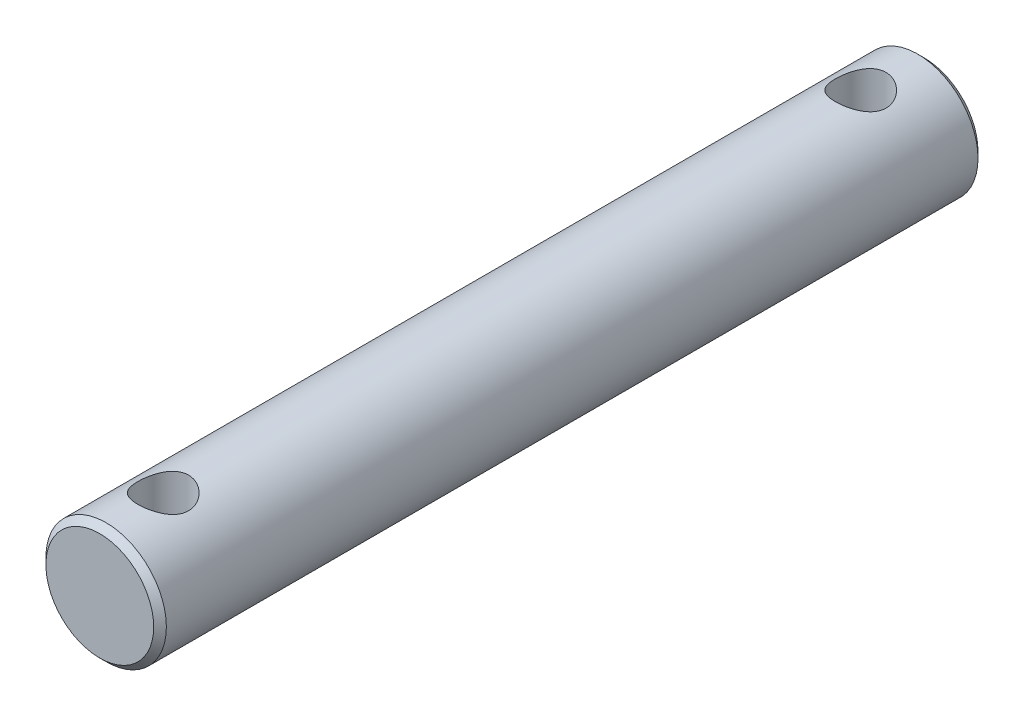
ISO-10303-21;
HEADER;
FILE_DESCRIPTION(('STEP AP214'),'2;1');
FILE_NAME('part.step','',(''),(''),'','','');
FILE_SCHEMA(('AUTOMOTIVE_DESIGN { 1 0 10303 214 1 1 1 1 }'));
ENDSEC;
DATA;
#1=APPLICATION_CONTEXT('core data for automotive mechanical design processes');
#2=APPLICATION_PROTOCOL_DEFINITION('international standard','automotive_design',2000,#1);
#3=PRODUCT_CONTEXT('',#1,'mechanical');
#4=PRODUCT('Part','Part','',(#3));
#5=PRODUCT_RELATED_PRODUCT_CATEGORY('part','',(#4));
#6=PRODUCT_DEFINITION_FORMATION('','',#4);
#7=PRODUCT_DEFINITION_CONTEXT('part definition',#1,'design');
#8=PRODUCT_DEFINITION('design','',#6,#7);
#9=PRODUCT_DEFINITION_SHAPE('','',#8);
#10=(LENGTH_UNIT() NAMED_UNIT(*) SI_UNIT(.MILLI.,.METRE.));
#11=(NAMED_UNIT(*) PLANE_ANGLE_UNIT() SI_UNIT($,.RADIAN.));
#12=(NAMED_UNIT(*) SI_UNIT($,.STERADIAN.) SOLID_ANGLE_UNIT());
#13=UNCERTAINTY_MEASURE_WITH_UNIT(LENGTH_MEASURE(1.E-05),#10,'distance_accuracy_value','');
#14=(GEOMETRIC_REPRESENTATION_CONTEXT(3) GLOBAL_UNCERTAINTY_ASSIGNED_CONTEXT((#13)) GLOBAL_UNIT_ASSIGNED_CONTEXT((#10,
#11,#12)) REPRESENTATION_CONTEXT('',''));
#15=CARTESIAN_POINT('',(0.,0.,0.));
#16=DIRECTION('',(0.,0.,1.));
#17=DIRECTION('',(1.,0.,0.));
#18=AXIS2_PLACEMENT_3D('',#15,#16,#17);
#19=CARTESIAN_POINT('',(0.,0.,130.));
#20=DIRECTION('',(0.,0.,-1.));
#21=DIRECTION('',(-1.,0.,0.));
#22=AXIS2_PLACEMENT_3D('',#19,#20,#21);
#23=CYLINDRICAL_SURFACE('',#22,9.5);
#24=CARTESIAN_POINT('',(0.,-9.5,124.));
#25=CARTESIAN_POINT('',(0.107078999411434,-9.49999937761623,123.99999921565));
#26=CARTESIAN_POINT('',(0.21419314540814,-9.49818453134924,123.995694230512));
#27=CARTESIAN_POINT('',(0.427655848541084,-9.4909710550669,123.978516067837));
#28=CARTESIAN_POINT('',(0.534003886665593,-9.48557019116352,123.965637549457));
#29=CARTESIAN_POINT('',(0.745324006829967,-9.47131035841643,123.93140747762));
#30=CARTESIAN_POINT('',(0.850292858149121,-9.46244439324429,123.910038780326));
#31=CARTESIAN_POINT('',(1.05789350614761,-9.44149236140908,123.85905542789));
#32=CARTESIAN_POINT('',(1.16052432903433,-9.4294049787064,123.829437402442));
#33=CARTESIAN_POINT('',(1.46306638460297,-9.38885324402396,123.72885874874));
#34=CARTESIAN_POINT('',(1.65859218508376,-9.3560299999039,123.646014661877));
#35=CARTESIAN_POINT('',(2.03267615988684,-9.28195642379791,123.451487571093));
#36=CARTESIAN_POINT('',(2.21123925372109,-9.24070854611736,123.339812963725));
#37=CARTESIAN_POINT('',(2.55586983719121,-9.15153804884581,123.084730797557));
#38=CARTESIAN_POINT('',(2.72096576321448,-9.10339381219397,122.940085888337));
#39=CARTESIAN_POINT('',(3.02537695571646,-9.00681174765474,122.625841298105));
#40=CARTESIAN_POINT('',(3.16467838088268,-8.95837377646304,122.45622830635));
#41=CARTESIAN_POINT('',(3.4205731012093,-8.86393002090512,122.086301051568));
#42=CARTESIAN_POINT('',(3.53566471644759,-8.81817052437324,121.884869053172));
#43=CARTESIAN_POINT('',(3.68128709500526,-8.75790365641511,121.568958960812));
#44=CARTESIAN_POINT('',(3.72533718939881,-8.7392044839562,121.461317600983));
#45=CARTESIAN_POINT('',(3.80402552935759,-8.70524153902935,121.24214260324));
#46=CARTESIAN_POINT('',(3.83866864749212,-8.68997598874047,121.130611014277));
#47=CARTESIAN_POINT('',(3.89670562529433,-8.66410097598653,120.909981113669));
#48=CARTESIAN_POINT('',(3.92056308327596,-8.65330180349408,120.801026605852));
#49=CARTESIAN_POINT('',(3.95911707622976,-8.63573057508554,120.581232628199));
#50=CARTESIAN_POINT('',(3.97381787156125,-8.62895664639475,120.470394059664));
#51=CARTESIAN_POINT('',(3.99388588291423,-8.61968668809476,120.2477263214));
#52=CARTESIAN_POINT('',(3.99925562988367,-8.61718949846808,120.135897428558));
#53=CARTESIAN_POINT('',(4.00059993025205,-8.616565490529,119.912175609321));
#54=CARTESIAN_POINT('',(3.99657499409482,-8.61843843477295,119.800282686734));
#55=CARTESIAN_POINT('',(3.97986846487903,-8.62616508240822,119.586180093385));
#56=CARTESIAN_POINT('',(3.96789489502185,-8.63169306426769,119.483902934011));
#57=CARTESIAN_POINT('',(3.93615791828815,-8.64621042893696,119.280803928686));
#58=CARTESIAN_POINT('',(3.91639196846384,-8.65520094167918,119.179982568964));
#59=CARTESIAN_POINT('',(3.84567869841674,-8.68697318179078,118.880775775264));
#60=CARTESIAN_POINT('',(3.78330187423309,-8.71456267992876,118.685471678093));
#61=CARTESIAN_POINT('',(3.6286715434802,-8.78008364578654,118.304100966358));
#62=CARTESIAN_POINT('',(3.53580482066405,-8.81822461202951,118.118323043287));
#63=CARTESIAN_POINT('',(3.32324765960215,-8.90050556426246,117.764226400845));
#64=CARTESIAN_POINT('',(3.20354651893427,-8.94464794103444,117.595914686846));
#65=CARTESIAN_POINT('',(2.92857575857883,-9.0386002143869,117.266246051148));
#66=CARTESIAN_POINT('',(2.7711254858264,-9.08857011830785,117.106749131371));
#67=CARTESIAN_POINT('',(2.43122666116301,-9.18533291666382,116.815789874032));
#68=CARTESIAN_POINT('',(2.2487720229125,-9.23212503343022,116.684334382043));
#69=CARTESIAN_POINT('',(1.85829187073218,-9.31867133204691,116.450386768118));
#70=CARTESIAN_POINT('',(1.64975736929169,-9.35822944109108,116.348666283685));
#71=CARTESIAN_POINT('',(1.21644453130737,-9.42433925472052,116.182405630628));
#72=CARTESIAN_POINT('',(0.991675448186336,-9.45089830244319,116.11784446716));
#73=CARTESIAN_POINT('',(0.547798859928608,-9.48663676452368,116.031662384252));
#74=CARTESIAN_POINT('',(0.329256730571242,-9.4968239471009,116.007547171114));
#75=CARTESIAN_POINT('',(-0.108971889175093,-9.5018990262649,115.9954862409));
#76=CARTESIAN_POINT('',(-0.328658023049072,-9.49679143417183,116.007529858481));
#77=CARTESIAN_POINT('',(-0.751156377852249,-9.47250256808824,116.065672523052));
#78=CARTESIAN_POINT('',(-0.954258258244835,-9.45405103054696,116.110006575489));
#79=CARTESIAN_POINT('',(-1.34991103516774,-9.40571577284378,116.229001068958));
#80=CARTESIAN_POINT('',(-1.54246060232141,-9.3758306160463,116.303665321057));
#81=CARTESIAN_POINT('',(-1.91831620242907,-9.30632825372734,116.483632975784));
#82=CARTESIAN_POINT('',(-2.10114763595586,-9.26643695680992,116.58981812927));
#83=CARTESIAN_POINT('',(-2.4470565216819,-9.18116014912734,116.828856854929));
#84=CARTESIAN_POINT('',(-2.61012560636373,-9.13577232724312,116.961721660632));
#85=CARTESIAN_POINT('',(-2.92436660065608,-9.04029795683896,117.261632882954));
#86=CARTESIAN_POINT('',(-3.07380435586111,-8.99011009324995,117.43046513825));
#87=CARTESIAN_POINT('',(-3.34277331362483,-8.89361242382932,117.79171831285));
#88=CARTESIAN_POINT('',(-3.46229718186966,-8.84730357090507,117.984144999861));
#89=CARTESIAN_POINT('',(-3.61717124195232,-8.78460228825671,118.288464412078));
#90=CARTESIAN_POINT('',(-3.66501597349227,-8.76469435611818,118.393444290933));
#91=CARTESIAN_POINT('',(-3.75160501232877,-8.72798220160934,118.607600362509));
#92=CARTESIAN_POINT('',(-3.7903533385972,-8.71117660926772,118.716774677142));
#93=CARTESIAN_POINT('',(-3.85831996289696,-8.6812871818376,118.938487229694));
#94=CARTESIAN_POINT('',(-3.88754282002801,-8.66820156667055,119.05102383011));
#95=CARTESIAN_POINT('',(-3.93613117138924,-8.64624688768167,119.278609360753));
#96=CARTESIAN_POINT('',(-3.95549762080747,-8.63737741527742,119.393658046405));
#97=CARTESIAN_POINT('',(-3.98299355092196,-8.62473021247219,119.616169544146));
#98=CARTESIAN_POINT('',(-3.99188563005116,-8.62060750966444,119.723519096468));
#99=CARTESIAN_POINT('',(-4.00098031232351,-8.6163903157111,119.938702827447));
#100=CARTESIAN_POINT('',(-4.00118000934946,-8.61629717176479,120.046537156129));
#101=CARTESIAN_POINT('',(-3.99287791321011,-8.62014787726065,120.261745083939));
#102=CARTESIAN_POINT('',(-3.98438075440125,-8.62408957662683,120.369118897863));
#103=CARTESIAN_POINT('',(-3.95880262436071,-8.63585937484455,120.582636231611));
#104=CARTESIAN_POINT('',(-3.94171841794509,-8.64368893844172,120.688779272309));
#105=CARTESIAN_POINT('',(-3.87992112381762,-8.67169378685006,120.993841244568));
#106=CARTESIAN_POINT('',(-3.82418249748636,-8.69663701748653,121.190212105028));
#107=CARTESIAN_POINT('',(-3.68429207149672,-8.75680990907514,121.570731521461));
#108=CARTESIAN_POINT('',(-3.60013225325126,-8.79204247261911,121.754876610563));
#109=CARTESIAN_POINT('',(-3.39987847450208,-8.87147603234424,122.118106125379));
#110=CARTESIAN_POINT('',(-3.2821534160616,-8.91609219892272,122.296201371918));
#111=CARTESIAN_POINT('',(-3.0204095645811,-9.00812884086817,122.63103922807));
#112=CARTESIAN_POINT('',(-2.87638134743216,-9.05555031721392,122.787774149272));
#113=CARTESIAN_POINT('',(-2.55314439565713,-9.15215079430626,123.087639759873));
#114=CARTESIAN_POINT('',(-2.37210679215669,-9.20119467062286,123.228867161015));
#115=CARTESIAN_POINT('',(-2.08362653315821,-9.26921496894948,123.416390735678));
#116=CARTESIAN_POINT('',(-1.98455747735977,-9.29097973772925,123.474883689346));
#117=CARTESIAN_POINT('',(-1.781365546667,-9.33206576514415,123.583290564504));
#118=CARTESIAN_POINT('',(-1.67724503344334,-9.35138815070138,123.6332084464));
#119=CARTESIAN_POINT('',(-1.46627527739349,-9.38676230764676,123.723304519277));
#120=CARTESIAN_POINT('',(-1.35949241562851,-9.40285971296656,123.763620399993));
#121=CARTESIAN_POINT('',(-1.14250130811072,-9.43168374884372,123.835065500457));
#122=CARTESIAN_POINT('',(-1.0322947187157,-9.44441198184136,123.86619908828));
#123=CARTESIAN_POINT('',(-0.809546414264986,-9.46610417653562,123.91889059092));
#124=CARTESIAN_POINT('',(-0.69701116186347,-9.47507738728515,123.940472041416));
#125=CARTESIAN_POINT('',(-0.470316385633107,-9.48902940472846,123.973903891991));
#126=CARTESIAN_POINT('',(-0.356158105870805,-9.49401111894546,123.985761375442));
#127=CARTESIAN_POINT('',(-0.201465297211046,-9.49794905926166,123.995126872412));
#128=CARTESIAN_POINT('',(-0.161199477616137,-9.49871771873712,123.996953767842));
#129=CARTESIAN_POINT('',(-0.0806240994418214,-9.49974330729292,123.999390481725));
#130=CARTESIAN_POINT('',(-0.0403145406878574,-9.50000023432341,124.000000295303));
#131=CARTESIAN_POINT('',(0.,-9.5,124.));
#132=B_SPLINE_CURVE_WITH_KNOTS('',3,(#24,#25,#26,#27,#28,#29,#30,#31,#32,#33,#34,#35,#36,#37,
#38,#39,#40,#41,#42,#43,#44,#45,#46,#47,#48,#49,#50,#51,#52,#53,#54,#55,#56,#57,#58,#59,#60,#61,
#62,#63,#64,#65,#66,#67,#68,#69,#70,#71,#72,#73,#74,#75,#76,#77,#78,#79,#80,#81,#82,#83,#84,#85,
#86,#87,#88,#89,#90,#91,#92,#93,#94,#95,#96,#97,#98,#99,#100,#101,#102,#103,#104,#105,#106,#107,
#108,#109,#110,#111,#112,#113,#114,#115,#116,#117,#118,#119,#120,#121,#122,#123,#124,#125,#126,
#127,#128,#129,#130,#131),.UNSPECIFIED.,.T.,.F.,(4,2,2,2,2,2,2,2,2,2,2,2,2,2,2,2,2,2,2,2,2,2,2,
2,2,2,2,2,2,2,2,2,2,2,2,2,2,2,2,2,2,2,2,2,2,2,2,2,2,2,2,2,2,4),(0.,0.321195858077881,
0.642591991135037,0.964640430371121,1.28682063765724,1.92827698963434,2.56954673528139,
3.24073282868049,3.91227804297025,4.61773018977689,4.97072952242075,5.32354566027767,
5.6592726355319,5.99484328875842,6.33032290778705,6.66578429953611,6.9747793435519,
7.28387530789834,7.90154384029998,8.53248546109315,9.16367917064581,9.849454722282,
10.5353974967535,11.2378184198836,11.939842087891,12.5967223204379,13.2534088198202,
13.876663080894,14.4999956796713,15.1427400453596,15.7857556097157,16.4756512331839,
17.1657158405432,17.5165480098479,17.8672248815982,18.2177336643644,18.5682084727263,
18.8911779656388,19.214255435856,19.5371608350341,19.8601879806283,20.4741711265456,
21.0883276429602,21.7398421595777,22.391590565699,23.092243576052,23.4431468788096,
23.7938876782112,24.1392468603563,24.4844414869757,24.828780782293,25.1728690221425,
25.293796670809,25.4147248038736),.UNSPECIFIED.);
#133=CARTESIAN_POINT('',(0.,-9.5,124.));
#134=VERTEX_POINT('',#133);
#135=EDGE_CURVE('E357',#134,#134,#132,.T.);
#136=ORIENTED_EDGE('',*,*,#135,.T.);
#137=EDGE_LOOP('',(#136));
#138=FACE_BOUND('',#137,.T.);
#139=CARTESIAN_POINT('',(0.,9.5,124.));
#140=CARTESIAN_POINT('',(-0.107078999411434,9.49999937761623,123.99999921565));
#141=CARTESIAN_POINT('',(-0.21419314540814,9.49818453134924,123.995694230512));
#142=CARTESIAN_POINT('',(-0.427655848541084,9.4909710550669,123.978516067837));
#143=CARTESIAN_POINT('',(-0.534003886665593,9.48557019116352,123.965637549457));
#144=CARTESIAN_POINT('',(-0.745324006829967,9.47131035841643,123.93140747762));
#145=CARTESIAN_POINT('',(-0.850292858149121,9.46244439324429,123.910038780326));
#146=CARTESIAN_POINT('',(-1.05789350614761,9.44149236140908,123.85905542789));
#147=CARTESIAN_POINT('',(-1.16052432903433,9.4294049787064,123.829437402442));
#148=CARTESIAN_POINT('',(-1.46306638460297,9.38885324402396,123.72885874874));
#149=CARTESIAN_POINT('',(-1.65859218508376,9.3560299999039,123.646014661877));
#150=CARTESIAN_POINT('',(-2.03267615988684,9.28195642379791,123.451487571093));
#151=CARTESIAN_POINT('',(-2.21123925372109,9.24070854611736,123.339812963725));
#152=CARTESIAN_POINT('',(-2.55586983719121,9.15153804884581,123.084730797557));
#153=CARTESIAN_POINT('',(-2.72096576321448,9.10339381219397,122.940085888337));
#154=CARTESIAN_POINT('',(-3.02537695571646,9.00681174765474,122.625841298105));
#155=CARTESIAN_POINT('',(-3.16467838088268,8.95837377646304,122.45622830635));
#156=CARTESIAN_POINT('',(-3.4205731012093,8.86393002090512,122.086301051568));
#157=CARTESIAN_POINT('',(-3.53566471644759,8.81817052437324,121.884869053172));
#158=CARTESIAN_POINT('',(-3.68128709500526,8.75790365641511,121.568958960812));
#159=CARTESIAN_POINT('',(-3.72533718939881,8.7392044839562,121.461317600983));
#160=CARTESIAN_POINT('',(-3.80402552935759,8.70524153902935,121.24214260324));
#161=CARTESIAN_POINT('',(-3.83866864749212,8.68997598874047,121.130611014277));
#162=CARTESIAN_POINT('',(-3.89670562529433,8.66410097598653,120.909981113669));
#163=CARTESIAN_POINT('',(-3.92056308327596,8.65330180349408,120.801026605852));
#164=CARTESIAN_POINT('',(-3.95911707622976,8.63573057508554,120.581232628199));
#165=CARTESIAN_POINT('',(-3.97381787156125,8.62895664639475,120.470394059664));
#166=CARTESIAN_POINT('',(-3.99388588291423,8.61968668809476,120.2477263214));
#167=CARTESIAN_POINT('',(-3.99925562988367,8.61718949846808,120.135897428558));
#168=CARTESIAN_POINT('',(-4.00059993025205,8.616565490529,119.912175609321));
#169=CARTESIAN_POINT('',(-3.99657499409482,8.61843843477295,119.800282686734));
#170=CARTESIAN_POINT('',(-3.97986846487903,8.62616508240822,119.586180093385));
#171=CARTESIAN_POINT('',(-3.96789489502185,8.63169306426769,119.483902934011));
#172=CARTESIAN_POINT('',(-3.93615791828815,8.64621042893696,119.280803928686));
#173=CARTESIAN_POINT('',(-3.91639196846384,8.65520094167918,119.179982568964));
#174=CARTESIAN_POINT('',(-3.84567869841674,8.68697318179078,118.880775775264));
#175=CARTESIAN_POINT('',(-3.78330187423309,8.71456267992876,118.685471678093));
#176=CARTESIAN_POINT('',(-3.6286715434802,8.78008364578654,118.304100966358));
#177=CARTESIAN_POINT('',(-3.53580482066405,8.81822461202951,118.118323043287));
#178=CARTESIAN_POINT('',(-3.32324765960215,8.90050556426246,117.764226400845));
#179=CARTESIAN_POINT('',(-3.20354651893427,8.94464794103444,117.595914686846));
#180=CARTESIAN_POINT('',(-2.92857575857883,9.0386002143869,117.266246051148));
#181=CARTESIAN_POINT('',(-2.7711254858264,9.08857011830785,117.106749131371));
#182=CARTESIAN_POINT('',(-2.43122666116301,9.18533291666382,116.815789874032));
#183=CARTESIAN_POINT('',(-2.2487720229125,9.23212503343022,116.684334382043));
#184=CARTESIAN_POINT('',(-1.85829187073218,9.31867133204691,116.450386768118));
#185=CARTESIAN_POINT('',(-1.64975736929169,9.35822944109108,116.348666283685));
#186=CARTESIAN_POINT('',(-1.21644453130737,9.42433925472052,116.182405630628));
#187=CARTESIAN_POINT('',(-0.991675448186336,9.45089830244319,116.11784446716));
#188=CARTESIAN_POINT('',(-0.547798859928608,9.48663676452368,116.031662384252));
#189=CARTESIAN_POINT('',(-0.329256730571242,9.4968239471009,116.007547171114));
#190=CARTESIAN_POINT('',(0.108971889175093,9.5018990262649,115.9954862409));
#191=CARTESIAN_POINT('',(0.328658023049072,9.49679143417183,116.007529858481));
#192=CARTESIAN_POINT('',(0.751156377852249,9.47250256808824,116.065672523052));
#193=CARTESIAN_POINT('',(0.954258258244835,9.45405103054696,116.110006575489));
#194=CARTESIAN_POINT('',(1.34991103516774,9.40571577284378,116.229001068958));
#195=CARTESIAN_POINT('',(1.54246060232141,9.3758306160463,116.303665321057));
#196=CARTESIAN_POINT('',(1.91831620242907,9.30632825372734,116.483632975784));
#197=CARTESIAN_POINT('',(2.10114763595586,9.26643695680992,116.58981812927));
#198=CARTESIAN_POINT('',(2.4470565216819,9.18116014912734,116.828856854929));
#199=CARTESIAN_POINT('',(2.61012560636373,9.13577232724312,116.961721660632));
#200=CARTESIAN_POINT('',(2.92436660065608,9.04029795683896,117.261632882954));
#201=CARTESIAN_POINT('',(3.07380435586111,8.99011009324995,117.43046513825));
#202=CARTESIAN_POINT('',(3.34277331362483,8.89361242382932,117.79171831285));
#203=CARTESIAN_POINT('',(3.46229718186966,8.84730357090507,117.984144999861));
#204=CARTESIAN_POINT('',(3.61717124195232,8.78460228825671,118.288464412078));
#205=CARTESIAN_POINT('',(3.66501597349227,8.76469435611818,118.393444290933));
#206=CARTESIAN_POINT('',(3.75160501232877,8.72798220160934,118.607600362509));
#207=CARTESIAN_POINT('',(3.7903533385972,8.71117660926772,118.716774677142));
#208=CARTESIAN_POINT('',(3.85831996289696,8.6812871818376,118.938487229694));
#209=CARTESIAN_POINT('',(3.88754282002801,8.66820156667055,119.05102383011));
#210=CARTESIAN_POINT('',(3.93613117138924,8.64624688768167,119.278609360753));
#211=CARTESIAN_POINT('',(3.95549762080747,8.63737741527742,119.393658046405));
#212=CARTESIAN_POINT('',(3.98299355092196,8.62473021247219,119.616169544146));
#213=CARTESIAN_POINT('',(3.99188563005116,8.62060750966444,119.723519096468));
#214=CARTESIAN_POINT('',(4.00098031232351,8.6163903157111,119.938702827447));
#215=CARTESIAN_POINT('',(4.00118000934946,8.61629717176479,120.046537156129));
#216=CARTESIAN_POINT('',(3.99287791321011,8.62014787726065,120.261745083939));
#217=CARTESIAN_POINT('',(3.98438075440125,8.62408957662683,120.369118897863));
#218=CARTESIAN_POINT('',(3.95880262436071,8.63585937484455,120.582636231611));
#219=CARTESIAN_POINT('',(3.94171841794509,8.64368893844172,120.688779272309));
#220=CARTESIAN_POINT('',(3.87992112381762,8.67169378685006,120.993841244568));
#221=CARTESIAN_POINT('',(3.82418249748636,8.69663701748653,121.190212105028));
#222=CARTESIAN_POINT('',(3.68429207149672,8.75680990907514,121.570731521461));
#223=CARTESIAN_POINT('',(3.60013225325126,8.79204247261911,121.754876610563));
#224=CARTESIAN_POINT('',(3.39987847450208,8.87147603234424,122.118106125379));
#225=CARTESIAN_POINT('',(3.2821534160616,8.91609219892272,122.296201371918));
#226=CARTESIAN_POINT('',(3.0204095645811,9.00812884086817,122.63103922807));
#227=CARTESIAN_POINT('',(2.87638134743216,9.05555031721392,122.787774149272));
#228=CARTESIAN_POINT('',(2.55314439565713,9.15215079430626,123.087639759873));
#229=CARTESIAN_POINT('',(2.37210679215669,9.20119467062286,123.228867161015));
#230=CARTESIAN_POINT('',(2.08362653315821,9.26921496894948,123.416390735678));
#231=CARTESIAN_POINT('',(1.98455747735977,9.29097973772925,123.474883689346));
#232=CARTESIAN_POINT('',(1.781365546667,9.33206576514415,123.583290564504));
#233=CARTESIAN_POINT('',(1.67724503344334,9.35138815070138,123.6332084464));
#234=CARTESIAN_POINT('',(1.46627527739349,9.38676230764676,123.723304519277));
#235=CARTESIAN_POINT('',(1.35949241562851,9.40285971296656,123.763620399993));
#236=CARTESIAN_POINT('',(1.14250130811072,9.43168374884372,123.835065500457));
#237=CARTESIAN_POINT('',(1.0322947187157,9.44441198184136,123.86619908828));
#238=CARTESIAN_POINT('',(0.809546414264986,9.46610417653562,123.91889059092));
#239=CARTESIAN_POINT('',(0.69701116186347,9.47507738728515,123.940472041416));
#240=CARTESIAN_POINT('',(0.470316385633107,9.48902940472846,123.973903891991));
#241=CARTESIAN_POINT('',(0.356158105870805,9.49401111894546,123.985761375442));
#242=CARTESIAN_POINT('',(0.201465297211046,9.49794905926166,123.995126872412));
#243=CARTESIAN_POINT('',(0.161199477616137,9.49871771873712,123.996953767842));
#244=CARTESIAN_POINT('',(0.0806240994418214,9.49974330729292,123.999390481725));
#245=CARTESIAN_POINT('',(0.0403145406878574,9.50000023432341,124.000000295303));
#246=CARTESIAN_POINT('',(0.,9.5,124.));
#247=B_SPLINE_CURVE_WITH_KNOTS('',3,(#139,#140,#141,#142,#143,#144,#145,#146,#147,#148,#149,
#150,#151,#152,#153,#154,#155,#156,#157,#158,#159,#160,#161,#162,#163,#164,#165,#166,#167,#168,
#169,#170,#171,#172,#173,#174,#175,#176,#177,#178,#179,#180,#181,#182,#183,#184,#185,#186,#187,
#188,#189,#190,#191,#192,#193,#194,#195,#196,#197,#198,#199,#200,#201,#202,#203,#204,#205,#206,
#207,#208,#209,#210,#211,#212,#213,#214,#215,#216,#217,#218,#219,#220,#221,#222,#223,#224,#225,
#226,#227,#228,#229,#230,#231,#232,#233,#234,#235,#236,#237,#238,#239,#240,#241,#242,#243,#244,
#245,#246),.UNSPECIFIED.,.T.,.F.,(4,2,2,2,2,2,2,2,2,2,2,2,2,2,2,2,2,2,2,2,2,2,2,2,2,2,2,2,2,2,2,
2,2,2,2,2,2,2,2,2,2,2,2,2,2,2,2,2,2,2,2,2,2,4),(0.,0.321195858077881,0.642591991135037,
0.964640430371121,1.28682063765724,1.92827698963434,2.56954673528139,3.24073282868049,
3.91227804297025,4.61773018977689,4.97072952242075,5.32354566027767,5.6592726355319,
5.99484328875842,6.33032290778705,6.66578429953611,6.9747793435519,7.28387530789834,
7.90154384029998,8.53248546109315,9.16367917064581,9.849454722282,10.5353974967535,
11.2378184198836,11.939842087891,12.5967223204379,13.2534088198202,13.876663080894,
14.4999956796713,15.1427400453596,15.7857556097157,16.4756512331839,17.1657158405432,
17.5165480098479,17.8672248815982,18.2177336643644,18.5682084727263,18.8911779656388,
19.214255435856,19.5371608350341,19.8601879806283,20.4741711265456,21.0883276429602,
21.7398421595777,22.391590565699,23.092243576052,23.4431468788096,23.7938876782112,
24.1392468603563,24.4844414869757,24.828780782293,25.1728690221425,25.293796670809,
25.4147248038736),.UNSPECIFIED.);
#248=CARTESIAN_POINT('',(0.,9.5,124.));
#249=VERTEX_POINT('',#248);
#250=EDGE_CURVE('E415',#249,#249,#247,.T.);
#251=ORIENTED_EDGE('',*,*,#250,.T.);
#252=EDGE_LOOP('',(#251));
#253=FACE_BOUND('',#252,.T.);
#254=CARTESIAN_POINT('',(0.,-9.5,14.));
#255=CARTESIAN_POINT('',(0.107078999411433,-9.49999937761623,13.9999992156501));
#256=CARTESIAN_POINT('',(0.21419314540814,-9.49818453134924,13.995694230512));
#257=CARTESIAN_POINT('',(0.427655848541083,-9.4909710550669,13.9785160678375));
#258=CARTESIAN_POINT('',(0.534003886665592,-9.48557019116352,13.9656375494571));
#259=CARTESIAN_POINT('',(0.745324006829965,-9.47131035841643,13.9314074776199));
#260=CARTESIAN_POINT('',(0.850292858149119,-9.46244439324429,13.910038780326));
#261=CARTESIAN_POINT('',(1.05789350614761,-9.44149236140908,13.85905542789));
#262=CARTESIAN_POINT('',(1.16052432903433,-9.4294049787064,13.8294374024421));
#263=CARTESIAN_POINT('',(1.46306638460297,-9.38885324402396,13.7288587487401));
#264=CARTESIAN_POINT('',(1.65859218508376,-9.3560299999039,13.6460146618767));
#265=CARTESIAN_POINT('',(2.03267615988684,-9.28195642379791,13.4514875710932));
#266=CARTESIAN_POINT('',(2.21123925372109,-9.24070854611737,13.3398129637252));
#267=CARTESIAN_POINT('',(2.55586983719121,-9.15153804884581,13.0847307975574));
#268=CARTESIAN_POINT('',(2.72096576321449,-9.10339381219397,12.9400858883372));
#269=CARTESIAN_POINT('',(3.02537695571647,-9.00681174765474,12.6258412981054));
#270=CARTESIAN_POINT('',(3.16467838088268,-8.95837377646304,12.4562283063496));
#271=CARTESIAN_POINT('',(3.42057310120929,-8.86393002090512,12.0863010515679));
#272=CARTESIAN_POINT('',(3.53566471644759,-8.81817052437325,11.8848690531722));
#273=CARTESIAN_POINT('',(3.68128709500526,-8.75790365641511,11.5689589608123));
#274=CARTESIAN_POINT('',(3.72533718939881,-8.7392044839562,11.4613176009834));
#275=CARTESIAN_POINT('',(3.80402552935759,-8.70524153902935,11.2421426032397));
#276=CARTESIAN_POINT('',(3.83866864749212,-8.68997598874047,11.130611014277));
#277=CARTESIAN_POINT('',(3.89670562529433,-8.66410097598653,10.9099811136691));
#278=CARTESIAN_POINT('',(3.92056308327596,-8.65330180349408,10.8010266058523));
#279=CARTESIAN_POINT('',(3.95911707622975,-8.63573057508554,10.5812326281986));
#280=CARTESIAN_POINT('',(3.97381787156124,-8.62895664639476,10.4703940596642));
#281=CARTESIAN_POINT('',(3.99388588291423,-8.61968668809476,10.2477263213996));
#282=CARTESIAN_POINT('',(3.99925562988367,-8.61718949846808,10.1358974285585));
#283=CARTESIAN_POINT('',(4.00059993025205,-8.616565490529,9.91217560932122));
#284=CARTESIAN_POINT('',(3.99657499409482,-8.61843843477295,9.80028268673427));
#285=CARTESIAN_POINT('',(3.97986846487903,-8.62616508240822,9.58618009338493));
#286=CARTESIAN_POINT('',(3.96789489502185,-8.63169306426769,9.48390293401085));
#287=CARTESIAN_POINT('',(3.93615791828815,-8.64621042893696,9.28080392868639));
#288=CARTESIAN_POINT('',(3.91639196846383,-8.65520094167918,9.17998256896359));
#289=CARTESIAN_POINT('',(3.84567869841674,-8.68697318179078,8.88077577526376));
#290=CARTESIAN_POINT('',(3.78330187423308,-8.71456267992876,8.68547167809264));
#291=CARTESIAN_POINT('',(3.6286715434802,-8.78008364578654,8.30410096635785));
#292=CARTESIAN_POINT('',(3.53580482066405,-8.81822461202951,8.11832304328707));
#293=CARTESIAN_POINT('',(3.32324765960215,-8.90050556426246,7.76422640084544));
#294=CARTESIAN_POINT('',(3.20354651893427,-8.94464794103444,7.59591468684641));
#295=CARTESIAN_POINT('',(2.92857575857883,-9.0386002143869,7.2662460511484));
#296=CARTESIAN_POINT('',(2.77112548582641,-9.08857011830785,7.10674913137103));
#297=CARTESIAN_POINT('',(2.43122666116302,-9.18533291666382,6.81578987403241));
#298=CARTESIAN_POINT('',(2.24877202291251,-9.23212503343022,6.68433438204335));
#299=CARTESIAN_POINT('',(1.85829187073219,-9.31867133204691,6.45038676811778));
#300=CARTESIAN_POINT('',(1.64975736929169,-9.35822944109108,6.34866628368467));
#301=CARTESIAN_POINT('',(1.21644453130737,-9.42433925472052,6.18240563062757));
#302=CARTESIAN_POINT('',(0.991675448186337,-9.45089830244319,6.11784446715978));
#303=CARTESIAN_POINT('',(0.547798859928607,-9.48663676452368,6.03166238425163));
#304=CARTESIAN_POINT('',(0.329256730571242,-9.4968239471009,6.00754717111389));
#305=CARTESIAN_POINT('',(-0.108971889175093,-9.5018990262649,5.99548624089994));
#306=CARTESIAN_POINT('',(-0.328658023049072,-9.49679143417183,6.00752985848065));
#307=CARTESIAN_POINT('',(-0.75115637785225,-9.47250256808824,6.06567252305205));
#308=CARTESIAN_POINT('',(-0.954258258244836,-9.45405103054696,6.11000657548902));
#309=CARTESIAN_POINT('',(-1.34991103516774,-9.40571577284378,6.22900106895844));
#310=CARTESIAN_POINT('',(-1.54246060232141,-9.3758306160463,6.30366532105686));
#311=CARTESIAN_POINT('',(-1.91831620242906,-9.30632825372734,6.48363297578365));
#312=CARTESIAN_POINT('',(-2.10114763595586,-9.26643695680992,6.58981812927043));
#313=CARTESIAN_POINT('',(-2.4470565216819,-9.18116014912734,6.82885685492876));
#314=CARTESIAN_POINT('',(-2.61012560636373,-9.13577232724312,6.96172166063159));
#315=CARTESIAN_POINT('',(-2.92436660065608,-9.04029795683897,7.26163288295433));
#316=CARTESIAN_POINT('',(-3.0738043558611,-8.99011009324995,7.4304651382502));
#317=CARTESIAN_POINT('',(-3.34277331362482,-8.89361242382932,7.79171831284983));
#318=CARTESIAN_POINT('',(-3.46229718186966,-8.84730357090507,7.98414499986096));
#319=CARTESIAN_POINT('',(-3.61717124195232,-8.78460228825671,8.28846441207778));
#320=CARTESIAN_POINT('',(-3.66501597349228,-8.76469435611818,8.39344429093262));
#321=CARTESIAN_POINT('',(-3.75160501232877,-8.72798220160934,8.60760036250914));
#322=CARTESIAN_POINT('',(-3.7903533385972,-8.71117660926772,8.71677467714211));
#323=CARTESIAN_POINT('',(-3.85831996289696,-8.6812871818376,8.93848722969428));
#324=CARTESIAN_POINT('',(-3.88754282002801,-8.66820156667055,9.05102383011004));
#325=CARTESIAN_POINT('',(-3.93613117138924,-8.64624688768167,9.27860936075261));
#326=CARTESIAN_POINT('',(-3.95549762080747,-8.63737741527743,9.39365804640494));
#327=CARTESIAN_POINT('',(-3.98299355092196,-8.62473021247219,9.61616954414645));
#328=CARTESIAN_POINT('',(-3.99188563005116,-8.62060750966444,9.72351909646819));
#329=CARTESIAN_POINT('',(-4.00098031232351,-8.61639031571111,9.93870282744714));
#330=CARTESIAN_POINT('',(-4.00118000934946,-8.61629717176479,10.0465371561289));
#331=CARTESIAN_POINT('',(-3.9928779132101,-8.62014787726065,10.2617450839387));
#332=CARTESIAN_POINT('',(-3.98438075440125,-8.62408957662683,10.3691188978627));
#333=CARTESIAN_POINT('',(-3.9588026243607,-8.63585937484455,10.5826362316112));
#334=CARTESIAN_POINT('',(-3.94171841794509,-8.64368893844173,10.688779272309));
#335=CARTESIAN_POINT('',(-3.87992112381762,-8.67169378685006,10.9938412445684));
#336=CARTESIAN_POINT('',(-3.82418249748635,-8.69663701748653,11.190212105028));
#337=CARTESIAN_POINT('',(-3.68429207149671,-8.75680990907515,11.5707315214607));
#338=CARTESIAN_POINT('',(-3.60013225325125,-8.79204247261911,11.7548766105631));
#339=CARTESIAN_POINT('',(-3.39987847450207,-8.87147603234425,12.1181061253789));
#340=CARTESIAN_POINT('',(-3.28215341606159,-8.91609219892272,12.2962013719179));
#341=CARTESIAN_POINT('',(-3.0204095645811,-9.00812884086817,12.6310392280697));
#342=CARTESIAN_POINT('',(-2.87638134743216,-9.05555031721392,12.7877741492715));
#343=CARTESIAN_POINT('',(-2.55314439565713,-9.15215079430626,13.0876397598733));
#344=CARTESIAN_POINT('',(-2.37210679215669,-9.20119467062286,13.2288671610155));
#345=CARTESIAN_POINT('',(-2.08362653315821,-9.26921496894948,13.4163907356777));
#346=CARTESIAN_POINT('',(-1.98455747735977,-9.29097973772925,13.4748836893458));
#347=CARTESIAN_POINT('',(-1.781365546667,-9.33206576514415,13.5832905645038));
#348=CARTESIAN_POINT('',(-1.67724503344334,-9.35138815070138,13.6332084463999));
#349=CARTESIAN_POINT('',(-1.4662752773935,-9.38676230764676,13.7233045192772));
#350=CARTESIAN_POINT('',(-1.35949241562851,-9.40285971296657,13.7636203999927));
#351=CARTESIAN_POINT('',(-1.14250130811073,-9.43168374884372,13.8350655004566));
#352=CARTESIAN_POINT('',(-1.03229471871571,-9.44441198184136,13.8661990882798));
#353=CARTESIAN_POINT('',(-0.809546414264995,-9.46610417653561,13.9188905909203));
#354=CARTESIAN_POINT('',(-0.697011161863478,-9.47507738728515,13.9404720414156));
#355=CARTESIAN_POINT('',(-0.470316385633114,-9.48902940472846,13.9739038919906));
#356=CARTESIAN_POINT('',(-0.35615810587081,-9.49401111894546,13.9857613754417));
#357=CARTESIAN_POINT('',(-0.201465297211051,-9.49794905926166,13.9951268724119));
#358=CARTESIAN_POINT('',(-0.161199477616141,-9.49871771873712,13.9969537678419));
#359=CARTESIAN_POINT('',(-0.0806240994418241,-9.49974330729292,13.9993904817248));
#360=CARTESIAN_POINT('',(-0.0403145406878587,-9.50000023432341,14.0000002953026));
#361=CARTESIAN_POINT('',(0.,-9.5,14.));
#362=B_SPLINE_CURVE_WITH_KNOTS('',3,(#254,#255,#256,#257,#258,#259,#260,#261,#262,#263,#264,
#265,#266,#267,#268,#269,#270,#271,#272,#273,#274,#275,#276,#277,#278,#279,#280,#281,#282,#283,
#284,#285,#286,#287,#288,#289,#290,#291,#292,#293,#294,#295,#296,#297,#298,#299,#300,#301,#302,
#303,#304,#305,#306,#307,#308,#309,#310,#311,#312,#313,#314,#315,#316,#317,#318,#319,#320,#321,
#322,#323,#324,#325,#326,#327,#328,#329,#330,#331,#332,#333,#334,#335,#336,#337,#338,#339,#340,
#341,#342,#343,#344,#345,#346,#347,#348,#349,#350,#351,#352,#353,#354,#355,#356,#357,#358,#359,
#360,#361),.UNSPECIFIED.,.T.,.F.,(4,2,2,2,2,2,2,2,2,2,2,2,2,2,2,2,2,2,2,2,2,2,2,2,2,2,2,2,2,2,2,
2,2,2,2,2,2,2,2,2,2,2,2,2,2,2,2,2,2,2,2,2,2,4),(0.,0.321195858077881,0.642591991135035,
0.964640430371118,1.28682063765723,1.92827698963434,2.56954673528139,3.24073282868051,
3.91227804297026,4.61773018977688,4.97072952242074,5.32354566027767,5.65927263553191,
5.99484328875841,6.33032290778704,6.66578429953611,6.9747793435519,7.28387530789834,
7.90154384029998,8.53248546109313,9.16367917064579,9.84945472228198,10.5353974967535,
11.2378184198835,11.939842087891,12.5967223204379,13.2534088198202,13.876663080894,
14.4999956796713,15.1427400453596,15.7857556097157,16.4756512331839,17.1657158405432,
17.5165480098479,17.8672248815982,18.2177336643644,18.5682084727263,18.8911779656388,
19.214255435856,19.5371608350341,19.8601879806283,20.4741711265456,21.0883276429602,
21.7398421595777,22.391590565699,23.092243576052,23.4431468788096,23.7938876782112,
24.1392468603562,24.4844414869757,24.828780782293,25.1728690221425,25.293796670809,
25.4147248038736),.UNSPECIFIED.);
#363=CARTESIAN_POINT('',(0.,-9.5,14.));
#364=VERTEX_POINT('',#363);
#365=EDGE_CURVE('E379',#364,#364,#362,.T.);
#366=ORIENTED_EDGE('',*,*,#365,.T.);
#367=EDGE_LOOP('',(#366));
#368=FACE_BOUND('',#367,.T.);
#369=CARTESIAN_POINT('',(0.,9.5,14.));
#370=CARTESIAN_POINT('',(-0.107078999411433,9.49999937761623,13.9999992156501));
#371=CARTESIAN_POINT('',(-0.21419314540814,9.49818453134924,13.995694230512));
#372=CARTESIAN_POINT('',(-0.427655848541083,9.4909710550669,13.9785160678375));
#373=CARTESIAN_POINT('',(-0.534003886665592,9.48557019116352,13.9656375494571));
#374=CARTESIAN_POINT('',(-0.745324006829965,9.47131035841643,13.9314074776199));
#375=CARTESIAN_POINT('',(-0.850292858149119,9.46244439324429,13.910038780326));
#376=CARTESIAN_POINT('',(-1.05789350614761,9.44149236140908,13.85905542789));
#377=CARTESIAN_POINT('',(-1.16052432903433,9.4294049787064,13.8294374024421));
#378=CARTESIAN_POINT('',(-1.46306638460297,9.38885324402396,13.7288587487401));
#379=CARTESIAN_POINT('',(-1.65859218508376,9.3560299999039,13.6460146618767));
#380=CARTESIAN_POINT('',(-2.03267615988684,9.28195642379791,13.4514875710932));
#381=CARTESIAN_POINT('',(-2.21123925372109,9.24070854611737,13.3398129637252));
#382=CARTESIAN_POINT('',(-2.55586983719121,9.15153804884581,13.0847307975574));
#383=CARTESIAN_POINT('',(-2.72096576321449,9.10339381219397,12.9400858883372));
#384=CARTESIAN_POINT('',(-3.02537695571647,9.00681174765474,12.6258412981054));
#385=CARTESIAN_POINT('',(-3.16467838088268,8.95837377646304,12.4562283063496));
#386=CARTESIAN_POINT('',(-3.42057310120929,8.86393002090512,12.0863010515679));
#387=CARTESIAN_POINT('',(-3.53566471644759,8.81817052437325,11.8848690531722));
#388=CARTESIAN_POINT('',(-3.68128709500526,8.75790365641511,11.5689589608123));
#389=CARTESIAN_POINT('',(-3.72533718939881,8.7392044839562,11.4613176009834));
#390=CARTESIAN_POINT('',(-3.80402552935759,8.70524153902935,11.2421426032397));
#391=CARTESIAN_POINT('',(-3.83866864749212,8.68997598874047,11.130611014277));
#392=CARTESIAN_POINT('',(-3.89670562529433,8.66410097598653,10.9099811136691));
#393=CARTESIAN_POINT('',(-3.92056308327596,8.65330180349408,10.8010266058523));
#394=CARTESIAN_POINT('',(-3.95911707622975,8.63573057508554,10.5812326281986));
#395=CARTESIAN_POINT('',(-3.97381787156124,8.62895664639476,10.4703940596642));
#396=CARTESIAN_POINT('',(-3.99388588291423,8.61968668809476,10.2477263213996));
#397=CARTESIAN_POINT('',(-3.99925562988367,8.61718949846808,10.1358974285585));
#398=CARTESIAN_POINT('',(-4.00059993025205,8.616565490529,9.91217560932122));
#399=CARTESIAN_POINT('',(-3.99657499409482,8.61843843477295,9.80028268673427));
#400=CARTESIAN_POINT('',(-3.97986846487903,8.62616508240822,9.58618009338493));
#401=CARTESIAN_POINT('',(-3.96789489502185,8.63169306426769,9.48390293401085));
#402=CARTESIAN_POINT('',(-3.93615791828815,8.64621042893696,9.28080392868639));
#403=CARTESIAN_POINT('',(-3.91639196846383,8.65520094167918,9.17998256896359));
#404=CARTESIAN_POINT('',(-3.84567869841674,8.68697318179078,8.88077577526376));
#405=CARTESIAN_POINT('',(-3.78330187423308,8.71456267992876,8.68547167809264));
#406=CARTESIAN_POINT('',(-3.6286715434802,8.78008364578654,8.30410096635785));
#407=CARTESIAN_POINT('',(-3.53580482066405,8.81822461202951,8.11832304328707));
#408=CARTESIAN_POINT('',(-3.32324765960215,8.90050556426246,7.76422640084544));
#409=CARTESIAN_POINT('',(-3.20354651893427,8.94464794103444,7.59591468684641));
#410=CARTESIAN_POINT('',(-2.92857575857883,9.0386002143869,7.2662460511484));
#411=CARTESIAN_POINT('',(-2.77112548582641,9.08857011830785,7.10674913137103));
#412=CARTESIAN_POINT('',(-2.43122666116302,9.18533291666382,6.81578987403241));
#413=CARTESIAN_POINT('',(-2.24877202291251,9.23212503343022,6.68433438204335));
#414=CARTESIAN_POINT('',(-1.85829187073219,9.31867133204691,6.45038676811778));
#415=CARTESIAN_POINT('',(-1.64975736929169,9.35822944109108,6.34866628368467));
#416=CARTESIAN_POINT('',(-1.21644453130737,9.42433925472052,6.18240563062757));
#417=CARTESIAN_POINT('',(-0.991675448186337,9.45089830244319,6.11784446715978));
#418=CARTESIAN_POINT('',(-0.547798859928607,9.48663676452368,6.03166238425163));
#419=CARTESIAN_POINT('',(-0.329256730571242,9.4968239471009,6.00754717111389));
#420=CARTESIAN_POINT('',(0.108971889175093,9.5018990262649,5.99548624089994));
#421=CARTESIAN_POINT('',(0.328658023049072,9.49679143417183,6.00752985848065));
#422=CARTESIAN_POINT('',(0.75115637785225,9.47250256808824,6.06567252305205));
#423=CARTESIAN_POINT('',(0.954258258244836,9.45405103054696,6.11000657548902));
#424=CARTESIAN_POINT('',(1.34991103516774,9.40571577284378,6.22900106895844));
#425=CARTESIAN_POINT('',(1.54246060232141,9.3758306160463,6.30366532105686));
#426=CARTESIAN_POINT('',(1.91831620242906,9.30632825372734,6.48363297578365));
#427=CARTESIAN_POINT('',(2.10114763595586,9.26643695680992,6.58981812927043));
#428=CARTESIAN_POINT('',(2.4470565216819,9.18116014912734,6.82885685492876));
#429=CARTESIAN_POINT('',(2.61012560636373,9.13577232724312,6.96172166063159));
#430=CARTESIAN_POINT('',(2.92436660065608,9.04029795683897,7.26163288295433));
#431=CARTESIAN_POINT('',(3.0738043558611,8.99011009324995,7.4304651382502));
#432=CARTESIAN_POINT('',(3.34277331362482,8.89361242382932,7.79171831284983));
#433=CARTESIAN_POINT('',(3.46229718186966,8.84730357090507,7.98414499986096));
#434=CARTESIAN_POINT('',(3.61717124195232,8.78460228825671,8.28846441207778));
#435=CARTESIAN_POINT('',(3.66501597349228,8.76469435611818,8.39344429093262));
#436=CARTESIAN_POINT('',(3.75160501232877,8.72798220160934,8.60760036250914));
#437=CARTESIAN_POINT('',(3.7903533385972,8.71117660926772,8.71677467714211));
#438=CARTESIAN_POINT('',(3.85831996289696,8.6812871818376,8.93848722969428));
#439=CARTESIAN_POINT('',(3.88754282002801,8.66820156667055,9.05102383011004));
#440=CARTESIAN_POINT('',(3.93613117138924,8.64624688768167,9.27860936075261));
#441=CARTESIAN_POINT('',(3.95549762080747,8.63737741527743,9.39365804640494));
#442=CARTESIAN_POINT('',(3.98299355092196,8.62473021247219,9.61616954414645));
#443=CARTESIAN_POINT('',(3.99188563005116,8.62060750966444,9.72351909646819));
#444=CARTESIAN_POINT('',(4.00098031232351,8.61639031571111,9.93870282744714));
#445=CARTESIAN_POINT('',(4.00118000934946,8.61629717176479,10.0465371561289));
#446=CARTESIAN_POINT('',(3.9928779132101,8.62014787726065,10.2617450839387));
#447=CARTESIAN_POINT('',(3.98438075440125,8.62408957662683,10.3691188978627));
#448=CARTESIAN_POINT('',(3.9588026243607,8.63585937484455,10.5826362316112));
#449=CARTESIAN_POINT('',(3.94171841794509,8.64368893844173,10.688779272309));
#450=CARTESIAN_POINT('',(3.87992112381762,8.67169378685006,10.9938412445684));
#451=CARTESIAN_POINT('',(3.82418249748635,8.69663701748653,11.190212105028));
#452=CARTESIAN_POINT('',(3.68429207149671,8.75680990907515,11.5707315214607));
#453=CARTESIAN_POINT('',(3.60013225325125,8.79204247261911,11.7548766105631));
#454=CARTESIAN_POINT('',(3.39987847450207,8.87147603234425,12.1181061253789));
#455=CARTESIAN_POINT('',(3.28215341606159,8.91609219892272,12.2962013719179));
#456=CARTESIAN_POINT('',(3.0204095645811,9.00812884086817,12.6310392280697));
#457=CARTESIAN_POINT('',(2.87638134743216,9.05555031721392,12.7877741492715));
#458=CARTESIAN_POINT('',(2.55314439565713,9.15215079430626,13.0876397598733));
#459=CARTESIAN_POINT('',(2.37210679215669,9.20119467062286,13.2288671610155));
#460=CARTESIAN_POINT('',(2.08362653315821,9.26921496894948,13.4163907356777));
#461=CARTESIAN_POINT('',(1.98455747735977,9.29097973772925,13.4748836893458));
#462=CARTESIAN_POINT('',(1.781365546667,9.33206576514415,13.5832905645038));
#463=CARTESIAN_POINT('',(1.67724503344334,9.35138815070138,13.6332084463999));
#464=CARTESIAN_POINT('',(1.4662752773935,9.38676230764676,13.7233045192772));
#465=CARTESIAN_POINT('',(1.35949241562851,9.40285971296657,13.7636203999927));
#466=CARTESIAN_POINT('',(1.14250130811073,9.43168374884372,13.8350655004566));
#467=CARTESIAN_POINT('',(1.03229471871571,9.44441198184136,13.8661990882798));
#468=CARTESIAN_POINT('',(0.809546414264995,9.46610417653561,13.9188905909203));
#469=CARTESIAN_POINT('',(0.697011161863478,9.47507738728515,13.9404720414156));
#470=CARTESIAN_POINT('',(0.470316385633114,9.48902940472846,13.9739038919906));
#471=CARTESIAN_POINT('',(0.35615810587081,9.49401111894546,13.9857613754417));
#472=CARTESIAN_POINT('',(0.201465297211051,9.49794905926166,13.9951268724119));
#473=CARTESIAN_POINT('',(0.161199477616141,9.49871771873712,13.9969537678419));
#474=CARTESIAN_POINT('',(0.0806240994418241,9.49974330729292,13.9993904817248));
#475=CARTESIAN_POINT('',(0.0403145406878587,9.50000023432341,14.0000002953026));
#476=CARTESIAN_POINT('',(0.,9.5,14.));
#477=B_SPLINE_CURVE_WITH_KNOTS('',3,(#369,#370,#371,#372,#373,#374,#375,#376,#377,#378,#379,
#380,#381,#382,#383,#384,#385,#386,#387,#388,#389,#390,#391,#392,#393,#394,#395,#396,#397,#398,
#399,#400,#401,#402,#403,#404,#405,#406,#407,#408,#409,#410,#411,#412,#413,#414,#415,#416,#417,
#418,#419,#420,#421,#422,#423,#424,#425,#426,#427,#428,#429,#430,#431,#432,#433,#434,#435,#436,
#437,#438,#439,#440,#441,#442,#443,#444,#445,#446,#447,#448,#449,#450,#451,#452,#453,#454,#455,
#456,#457,#458,#459,#460,#461,#462,#463,#464,#465,#466,#467,#468,#469,#470,#471,#472,#473,#474,
#475,#476),.UNSPECIFIED.,.T.,.F.,(4,2,2,2,2,2,2,2,2,2,2,2,2,2,2,2,2,2,2,2,2,2,2,2,2,2,2,2,2,2,2,
2,2,2,2,2,2,2,2,2,2,2,2,2,2,2,2,2,2,2,2,2,2,4),(0.,0.321195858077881,0.642591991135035,
0.964640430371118,1.28682063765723,1.92827698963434,2.56954673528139,3.24073282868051,
3.91227804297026,4.61773018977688,4.97072952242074,5.32354566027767,5.65927263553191,
5.99484328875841,6.33032290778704,6.66578429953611,6.9747793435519,7.28387530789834,
7.90154384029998,8.53248546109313,9.16367917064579,9.84945472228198,10.5353974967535,
11.2378184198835,11.939842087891,12.5967223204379,13.2534088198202,13.876663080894,
14.4999956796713,15.1427400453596,15.7857556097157,16.4756512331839,17.1657158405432,
17.5165480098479,17.8672248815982,18.2177336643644,18.5682084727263,18.8911779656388,
19.214255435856,19.5371608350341,19.8601879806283,20.4741711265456,21.0883276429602,
21.7398421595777,22.391590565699,23.092243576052,23.4431468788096,23.7938876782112,
24.1392468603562,24.4844414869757,24.828780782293,25.1728690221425,25.293796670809,
25.4147248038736),.UNSPECIFIED.);
#478=CARTESIAN_POINT('',(0.,9.5,14.));
#479=VERTEX_POINT('',#478);
#480=EDGE_CURVE('E373',#479,#479,#477,.T.);
#481=ORIENTED_EDGE('',*,*,#480,.T.);
#482=EDGE_LOOP('',(#481));
#483=FACE_BOUND('',#482,.T.);
#484=CARTESIAN_POINT('',(0.,0.,1.));
#485=DIRECTION('',(0.,0.,1.));
#486=DIRECTION('',(1.,0.,0.));
#487=AXIS2_PLACEMENT_3D('',#484,#485,#486);
#488=CIRCLE('',#487,9.5);
#489=CARTESIAN_POINT('',(9.5,0.,1.));
#490=VERTEX_POINT('',#489);
#491=EDGE_CURVE('E369',#490,#490,#488,.T.);
#492=ORIENTED_EDGE('',*,*,#491,.T.);
#493=EDGE_LOOP('',(#492));
#494=FACE_BOUND('',#493,.T.);
#495=CARTESIAN_POINT('',(0.,0.,129.));
#496=DIRECTION('',(0.,0.,1.));
#497=DIRECTION('',(1.,0.,0.));
#498=AXIS2_PLACEMENT_3D('',#495,#496,#497);
#499=CIRCLE('',#498,9.5);
#500=CARTESIAN_POINT('',(9.5,0.,129.));
#501=VERTEX_POINT('',#500);
#502=EDGE_CURVE('E426',#501,#501,#499,.F.);
#503=ORIENTED_EDGE('',*,*,#502,.T.);
#504=EDGE_LOOP('',(#503));
#505=FACE_BOUND('',#504,.T.);
#506=ADVANCED_FACE('F353',(#138,#253,#368,#483,#494,#505),#23,.T.);
#507=CARTESIAN_POINT('',(0.,0.,130.));
#508=DIRECTION('',(0.,0.,1.));
#509=DIRECTION('',(1.,0.,0.));
#510=AXIS2_PLACEMENT_3D('',#507,#508,#509);
#511=PLANE('',#510);
#512=CARTESIAN_POINT('',(0.,0.,130.));
#513=DIRECTION('',(0.,0.,1.));
#514=DIRECTION('',(1.,0.,0.));
#515=AXIS2_PLACEMENT_3D('',#512,#513,#514);
#516=CIRCLE('',#515,8.5);
#517=CARTESIAN_POINT('',(8.5,0.,130.));
#518=VERTEX_POINT('',#517);
#519=EDGE_CURVE('E10',#518,#518,#516,.T.);
#520=ORIENTED_EDGE('',*,*,#519,.T.);
#521=EDGE_LOOP('',(#520));
#522=FACE_BOUND('',#521,.T.);
#523=ADVANCED_FACE('F400',(#522),#511,.T.);
#524=CARTESIAN_POINT('',(0.,0.,0.));
#525=DIRECTION('',(0.,0.,1.));
#526=DIRECTION('',(1.,0.,0.));
#527=AXIS2_PLACEMENT_3D('',#524,#525,#526);
#528=PLANE('',#527);
#529=CARTESIAN_POINT('',(0.,0.,0.));
#530=DIRECTION('',(0.,0.,1.));
#531=DIRECTION('',(1.,0.,0.));
#532=AXIS2_PLACEMENT_3D('',#529,#530,#531);
#533=CIRCLE('',#532,8.49999999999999);
#534=CARTESIAN_POINT('',(8.49999999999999,0.,0.));
#535=VERTEX_POINT('',#534);
#536=EDGE_CURVE('E364',#535,#535,#533,.F.);
#537=ORIENTED_EDGE('',*,*,#536,.T.);
#538=EDGE_LOOP('',(#537));
#539=FACE_BOUND('',#538,.T.);
#540=ADVANCED_FACE('F397',(#539),#528,.F.);
#541=CARTESIAN_POINT('',(0.,0.,1.));
#542=DIRECTION('',(0.,0.,1.));
#543=DIRECTION('',(1.,0.,0.));
#544=AXIS2_PLACEMENT_3D('',#541,#542,#543);
#545=CONICAL_SURFACE('',#544,9.5,0.785398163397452);
#546=ORIENTED_EDGE('',*,*,#536,.F.);
#547=EDGE_LOOP('',(#546));
#548=FACE_BOUND('',#547,.T.);
#549=ORIENTED_EDGE('',*,*,#491,.F.);
#550=EDGE_LOOP('',(#549));
#551=FACE_BOUND('',#550,.T.);
#552=ADVANCED_FACE('F393',(#548,#551),#545,.T.);
#553=CARTESIAN_POINT('',(0.,0.,130.));
#554=DIRECTION('',(0.,0.,-1.));
#555=DIRECTION('',(-1.,0.,0.));
#556=AXIS2_PLACEMENT_3D('',#553,#554,#555);
#557=CONICAL_SURFACE('',#556,8.5,0.785398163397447);
#558=ORIENTED_EDGE('',*,*,#502,.F.);
#559=EDGE_LOOP('',(#558));
#560=FACE_BOUND('',#559,.T.);
#561=ORIENTED_EDGE('',*,*,#519,.F.);
#562=EDGE_LOOP('',(#561));
#563=FACE_BOUND('',#562,.T.);
#564=ADVANCED_FACE('F387',(#560,#563),#557,.T.);
#565=CARTESIAN_POINT('',(0.,-65.,10.));
#566=DIRECTION('',(0.,1.,0.));
#567=DIRECTION('',(0.,0.,1.));
#568=AXIS2_PLACEMENT_3D('',#565,#566,#567);
#569=CYLINDRICAL_SURFACE('',#568,4.);
#570=ORIENTED_EDGE('',*,*,#480,.F.);
#571=EDGE_LOOP('',(#570));
#572=FACE_BOUND('',#571,.T.);
#573=ORIENTED_EDGE('',*,*,#365,.F.);
#574=EDGE_LOOP('',(#573));
#575=FACE_BOUND('',#574,.T.);
#576=ADVANCED_FACE('F382',(#572,#575),#569,.F.);
#577=CARTESIAN_POINT('',(0.,-65.,120.));
#578=DIRECTION('',(0.,1.,0.));
#579=DIRECTION('',(0.,0.,1.));
#580=AXIS2_PLACEMENT_3D('',#577,#578,#579);
#581=CYLINDRICAL_SURFACE('',#580,4.);
#582=ORIENTED_EDGE('',*,*,#250,.F.);
#583=EDGE_LOOP('',(#582));
#584=FACE_BOUND('',#583,.T.);
#585=ORIENTED_EDGE('',*,*,#135,.F.);
#586=EDGE_LOOP('',(#585));
#587=FACE_BOUND('',#586,.T.);
#588=ADVANCED_FACE('F386',(#584,#587),#581,.F.);
#589=CLOSED_SHELL('',(#506,#523,#540,#552,#564,#576,#588));
#590=MANIFOLD_SOLID_BREP('B2',#589);
#591=ADVANCED_BREP_SHAPE_REPRESENTATION('',(#18,#590),#14);
#592=SHAPE_DEFINITION_REPRESENTATION(#9,#591);
ENDSEC;
END-ISO-10303-21;
